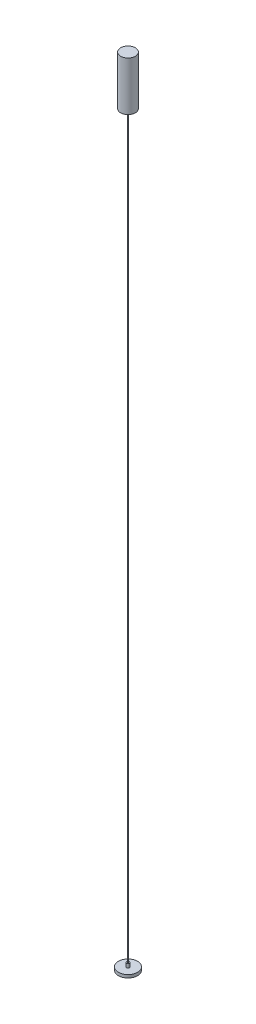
ISO-10303-21;
HEADER;
FILE_DESCRIPTION(('STEP AP214'),'2;1');
FILE_NAME('part.step','',(''),(''),'','','');
FILE_SCHEMA(('AUTOMOTIVE_DESIGN { 1 0 10303 214 1 1 1 1 }'));
ENDSEC;
DATA;
#1=APPLICATION_CONTEXT('core data for automotive mechanical design processes');
#2=APPLICATION_PROTOCOL_DEFINITION('international standard','automotive_design',2000,#1);
#3=PRODUCT_CONTEXT('',#1,'mechanical');
#4=PRODUCT('Part','Part','',(#3));
#5=PRODUCT_RELATED_PRODUCT_CATEGORY('part','',(#4));
#6=PRODUCT_DEFINITION_FORMATION('','',#4);
#7=PRODUCT_DEFINITION_CONTEXT('part definition',#1,'design');
#8=PRODUCT_DEFINITION('design','',#6,#7);
#9=PRODUCT_DEFINITION_SHAPE('','',#8);
#10=(LENGTH_UNIT() NAMED_UNIT(*) SI_UNIT(.MILLI.,.METRE.));
#11=(NAMED_UNIT(*) PLANE_ANGLE_UNIT() SI_UNIT($,.RADIAN.));
#12=(NAMED_UNIT(*) SI_UNIT($,.STERADIAN.) SOLID_ANGLE_UNIT());
#13=UNCERTAINTY_MEASURE_WITH_UNIT(LENGTH_MEASURE(1.E-05),#10,'distance_accuracy_value','');
#14=(GEOMETRIC_REPRESENTATION_CONTEXT(3) GLOBAL_UNCERTAINTY_ASSIGNED_CONTEXT((#13)) GLOBAL_UNIT_ASSIGNED_CONTEXT((#10,
#11,#12)) REPRESENTATION_CONTEXT('',''));
#15=CARTESIAN_POINT('',(0.,0.,0.));
#16=DIRECTION('',(0.,0.,1.));
#17=DIRECTION('',(1.,0.,0.));
#18=AXIS2_PLACEMENT_3D('',#15,#16,#17);
#19=CARTESIAN_POINT('',(0.,3242.,0.));
#20=DIRECTION('',(0.,-1.,0.));
#21=DIRECTION('',(0.,0.,-1.));
#22=AXIS2_PLACEMENT_3D('',#19,#20,#21);
#23=CYLINDRICAL_SURFACE('',#22,30.);
#24=CARTESIAN_POINT('',(0.,3242.,0.));
#25=DIRECTION('',(0.,1.,0.));
#26=DIRECTION('',(0.,0.,1.));
#27=AXIS2_PLACEMENT_3D('',#24,#25,#26);
#28=CIRCLE('',#27,30.);
#29=CARTESIAN_POINT('',(0.,3242.,30.));
#30=VERTEX_POINT('',#29);
#31=EDGE_CURVE('E11',#30,#30,#28,.T.);
#32=ORIENTED_EDGE('',*,*,#31,.F.);
#33=EDGE_LOOP('',(#32));
#34=FACE_BOUND('',#33,.T.);
#35=CARTESIAN_POINT('',(0.,3042.,0.));
#36=DIRECTION('',(0.,1.,0.));
#37=DIRECTION('',(0.,0.,1.));
#38=AXIS2_PLACEMENT_3D('',#35,#36,#37);
#39=CIRCLE('',#38,30.);
#40=CARTESIAN_POINT('',(0.,3042.,30.));
#41=VERTEX_POINT('',#40);
#42=EDGE_CURVE('E43',#41,#41,#39,.T.);
#43=ORIENTED_EDGE('',*,*,#42,.T.);
#44=EDGE_LOOP('',(#43));
#45=FACE_BOUND('',#44,.T.);
#46=ADVANCED_FACE('F40',(#34,#45),#23,.T.);
#47=CARTESIAN_POINT('',(0.,3242.,0.));
#48=DIRECTION('',(0.,1.,0.));
#49=DIRECTION('',(0.,0.,1.));
#50=AXIS2_PLACEMENT_3D('',#47,#48,#49);
#51=PLANE('',#50);
#52=ORIENTED_EDGE('',*,*,#31,.T.);
#53=EDGE_LOOP('',(#52));
#54=FACE_BOUND('',#53,.T.);
#55=ADVANCED_FACE('F55',(#54),#51,.T.);
#56=CARTESIAN_POINT('',(0.,3042.,0.));
#57=DIRECTION('',(0.,1.,0.));
#58=DIRECTION('',(0.,0.,1.));
#59=AXIS2_PLACEMENT_3D('',#56,#57,#58);
#60=PLANE('',#59);
#61=ORIENTED_EDGE('',*,*,#42,.F.);
#62=EDGE_LOOP('',(#61));
#63=FACE_BOUND('',#62,.T.);
#64=ADVANCED_FACE('F53',(#63),#60,.F.);
#65=CLOSED_SHELL('',(#46,#55,#64));
#66=MANIFOLD_SOLID_BREP('B2',#65);
#67=CARTESIAN_POINT('',(-0.223517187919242,3042.,0.));
#68=DIRECTION('',(0.,-1.,0.));
#69=DIRECTION('',(0.,0.,-1.));
#70=AXIS2_PLACEMENT_3D('',#67,#68,#69);
#71=CYLINDRICAL_SURFACE('',#70,6.);
#72=CARTESIAN_POINT('',(-0.223517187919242,3042.,0.));
#73=DIRECTION('',(0.,1.,0.));
#74=DIRECTION('',(0.,0.,1.));
#75=AXIS2_PLACEMENT_3D('',#72,#73,#74);
#76=CIRCLE('',#75,6.);
#77=CARTESIAN_POINT('',(-0.223517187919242,3042.,6.));
#78=VERTEX_POINT('',#77);
#79=EDGE_CURVE('E39',#78,#78,#76,.T.);
#80=ORIENTED_EDGE('',*,*,#79,.F.);
#81=EDGE_LOOP('',(#80));
#82=FACE_BOUND('',#81,.T.);
#83=CARTESIAN_POINT('',(-0.223517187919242,3027.,0.));
#84=DIRECTION('',(0.,1.,0.));
#85=DIRECTION('',(0.,0.,1.));
#86=AXIS2_PLACEMENT_3D('',#83,#84,#85);
#87=CIRCLE('',#86,6.);
#88=CARTESIAN_POINT('',(-0.223517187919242,3027.,6.));
#89=VERTEX_POINT('',#88);
#90=EDGE_CURVE('E92',#89,#89,#87,.T.);
#91=ORIENTED_EDGE('',*,*,#90,.T.);
#92=EDGE_LOOP('',(#91));
#93=FACE_BOUND('',#92,.T.);
#94=ADVANCED_FACE('F89',(#82,#93),#71,.T.);
#95=CARTESIAN_POINT('',(-0.223517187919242,3042.,0.));
#96=DIRECTION('',(0.,1.,0.));
#97=DIRECTION('',(0.,0.,1.));
#98=AXIS2_PLACEMENT_3D('',#95,#96,#97);
#99=PLANE('',#98);
#100=ORIENTED_EDGE('',*,*,#79,.T.);
#101=EDGE_LOOP('',(#100));
#102=FACE_BOUND('',#101,.T.);
#103=ADVANCED_FACE('F104',(#102),#99,.T.);
#104=CARTESIAN_POINT('',(-0.223517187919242,3027.,0.));
#105=DIRECTION('',(0.,1.,0.));
#106=DIRECTION('',(0.,0.,1.));
#107=AXIS2_PLACEMENT_3D('',#104,#105,#106);
#108=PLANE('',#107);
#109=ORIENTED_EDGE('',*,*,#90,.F.);
#110=EDGE_LOOP('',(#109));
#111=FACE_BOUND('',#110,.T.);
#112=ADVANCED_FACE('F102',(#111),#108,.F.);
#113=CLOSED_SHELL('',(#94,#103,#112));
#114=MANIFOLD_SOLID_BREP('B6',#113);
#115=CARTESIAN_POINT('',(0.,3027.,0.));
#116=DIRECTION('',(0.,-1.,0.));
#117=DIRECTION('',(0.,0.,-1.));
#118=AXIS2_PLACEMENT_3D('',#115,#116,#117);
#119=CYLINDRICAL_SURFACE('',#118,2.);
#120=CARTESIAN_POINT('',(0.,3027.,0.));
#121=DIRECTION('',(0.,1.,0.));
#122=DIRECTION('',(0.,0.,1.));
#123=AXIS2_PLACEMENT_3D('',#120,#121,#122);
#124=CIRCLE('',#123,2.);
#125=CARTESIAN_POINT('',(0.,3027.,2.));
#126=VERTEX_POINT('',#125);
#127=EDGE_CURVE('E88',#126,#126,#124,.T.);
#128=ORIENTED_EDGE('',*,*,#127,.F.);
#129=EDGE_LOOP('',(#128));
#130=FACE_BOUND('',#129,.T.);
#131=CARTESIAN_POINT('',(0.,27.,0.));
#132=DIRECTION('',(0.,1.,0.));
#133=DIRECTION('',(0.,0.,1.));
#134=AXIS2_PLACEMENT_3D('',#131,#132,#133);
#135=CIRCLE('',#134,2.);
#136=CARTESIAN_POINT('',(0.,27.,2.));
#137=VERTEX_POINT('',#136);
#138=EDGE_CURVE('E141',#137,#137,#135,.T.);
#139=ORIENTED_EDGE('',*,*,#138,.T.);
#140=EDGE_LOOP('',(#139));
#141=FACE_BOUND('',#140,.T.);
#142=ADVANCED_FACE('F138',(#130,#141),#119,.T.);
#143=CARTESIAN_POINT('',(0.,3027.,0.));
#144=DIRECTION('',(0.,1.,0.));
#145=DIRECTION('',(0.,0.,1.));
#146=AXIS2_PLACEMENT_3D('',#143,#144,#145);
#147=PLANE('',#146);
#148=ORIENTED_EDGE('',*,*,#127,.T.);
#149=EDGE_LOOP('',(#148));
#150=FACE_BOUND('',#149,.T.);
#151=ADVANCED_FACE('F153',(#150),#147,.T.);
#152=CARTESIAN_POINT('',(0.,27.,0.));
#153=DIRECTION('',(0.,1.,0.));
#154=DIRECTION('',(0.,0.,1.));
#155=AXIS2_PLACEMENT_3D('',#152,#153,#154);
#156=PLANE('',#155);
#157=ORIENTED_EDGE('',*,*,#138,.F.);
#158=EDGE_LOOP('',(#157));
#159=FACE_BOUND('',#158,.T.);
#160=ADVANCED_FACE('F151',(#159),#156,.F.);
#161=CLOSED_SHELL('',(#142,#151,#160));
#162=MANIFOLD_SOLID_BREP('B34',#161);
#163=CARTESIAN_POINT('',(0.,27.,0.));
#164=DIRECTION('',(0.,-1.,0.));
#165=DIRECTION('',(0.,0.,-1.));
#166=AXIS2_PLACEMENT_3D('',#163,#164,#165);
#167=CYLINDRICAL_SURFACE('',#166,6.);
#168=CARTESIAN_POINT('',(0.,27.,0.));
#169=DIRECTION('',(0.,1.,0.));
#170=DIRECTION('',(0.,0.,1.));
#171=AXIS2_PLACEMENT_3D('',#168,#169,#170);
#172=CIRCLE('',#171,6.);
#173=CARTESIAN_POINT('',(0.,27.,6.));
#174=VERTEX_POINT('',#173);
#175=EDGE_CURVE('E137',#174,#174,#172,.T.);
#176=ORIENTED_EDGE('',*,*,#175,.F.);
#177=EDGE_LOOP('',(#176));
#178=FACE_BOUND('',#177,.T.);
#179=CARTESIAN_POINT('',(0.,12.,0.));
#180=DIRECTION('',(0.,1.,0.));
#181=DIRECTION('',(0.,0.,1.));
#182=AXIS2_PLACEMENT_3D('',#179,#180,#181);
#183=CIRCLE('',#182,6.);
#184=CARTESIAN_POINT('',(0.,12.,6.));
#185=VERTEX_POINT('',#184);
#186=EDGE_CURVE('E189',#185,#185,#183,.T.);
#187=ORIENTED_EDGE('',*,*,#186,.T.);
#188=EDGE_LOOP('',(#187));
#189=FACE_BOUND('',#188,.T.);
#190=ADVANCED_FACE('F186',(#178,#189),#167,.T.);
#191=CARTESIAN_POINT('',(0.,27.,0.));
#192=DIRECTION('',(0.,1.,0.));
#193=DIRECTION('',(0.,0.,1.));
#194=AXIS2_PLACEMENT_3D('',#191,#192,#193);
#195=PLANE('',#194);
#196=ORIENTED_EDGE('',*,*,#175,.T.);
#197=EDGE_LOOP('',(#196));
#198=FACE_BOUND('',#197,.T.);
#199=ADVANCED_FACE('F201',(#198),#195,.T.);
#200=CARTESIAN_POINT('',(0.,12.,0.));
#201=DIRECTION('',(0.,1.,0.));
#202=DIRECTION('',(0.,0.,1.));
#203=AXIS2_PLACEMENT_3D('',#200,#201,#202);
#204=PLANE('',#203);
#205=ORIENTED_EDGE('',*,*,#186,.F.);
#206=EDGE_LOOP('',(#205));
#207=FACE_BOUND('',#206,.T.);
#208=ADVANCED_FACE('F199',(#207),#204,.F.);
#209=CLOSED_SHELL('',(#190,#199,#208));
#210=MANIFOLD_SOLID_BREP('B83',#209);
#211=CARTESIAN_POINT('',(0.,12.,0.));
#212=DIRECTION('',(0.,-1.,0.));
#213=DIRECTION('',(0.,0.,-1.));
#214=AXIS2_PLACEMENT_3D('',#211,#212,#213);
#215=CYLINDRICAL_SURFACE('',#214,39.);
#216=CARTESIAN_POINT('',(0.,12.,0.));
#217=DIRECTION('',(0.,1.,0.));
#218=DIRECTION('',(0.,0.,1.));
#219=AXIS2_PLACEMENT_3D('',#216,#217,#218);
#220=CIRCLE('',#219,39.);
#221=CARTESIAN_POINT('',(0.,12.,39.));
#222=VERTEX_POINT('',#221);
#223=EDGE_CURVE('E185',#222,#222,#220,.T.);
#224=ORIENTED_EDGE('',*,*,#223,.F.);
#225=EDGE_LOOP('',(#224));
#226=FACE_BOUND('',#225,.T.);
#227=CARTESIAN_POINT('',(0.,0.,0.));
#228=DIRECTION('',(0.,1.,0.));
#229=DIRECTION('',(0.,0.,1.));
#230=AXIS2_PLACEMENT_3D('',#227,#228,#229);
#231=CIRCLE('',#230,39.);
#232=CARTESIAN_POINT('',(0.,0.,39.));
#233=VERTEX_POINT('',#232);
#234=EDGE_CURVE('E230',#233,#233,#231,.T.);
#235=ORIENTED_EDGE('',*,*,#234,.T.);
#236=EDGE_LOOP('',(#235));
#237=FACE_BOUND('',#236,.T.);
#238=ADVANCED_FACE('F227',(#226,#237),#215,.T.);
#239=CARTESIAN_POINT('',(0.,12.,0.));
#240=DIRECTION('',(0.,1.,0.));
#241=DIRECTION('',(0.,0.,1.));
#242=AXIS2_PLACEMENT_3D('',#239,#240,#241);
#243=PLANE('',#242);
#244=ORIENTED_EDGE('',*,*,#223,.T.);
#245=EDGE_LOOP('',(#244));
#246=FACE_BOUND('',#245,.T.);
#247=ADVANCED_FACE('F242',(#246),#243,.T.);
#248=CARTESIAN_POINT('',(0.,0.,0.));
#249=DIRECTION('',(0.,1.,0.));
#250=DIRECTION('',(0.,0.,1.));
#251=AXIS2_PLACEMENT_3D('',#248,#249,#250);
#252=PLANE('',#251);
#253=ORIENTED_EDGE('',*,*,#234,.F.);
#254=EDGE_LOOP('',(#253));
#255=FACE_BOUND('',#254,.T.);
#256=ADVANCED_FACE('F240',(#255),#252,.F.);
#257=CLOSED_SHELL('',(#238,#247,#256));
#258=MANIFOLD_SOLID_BREP('B132',#257);
#259=ADVANCED_BREP_SHAPE_REPRESENTATION('',(#18,#66,#114,#162,#210,#258),#14);
#260=SHAPE_DEFINITION_REPRESENTATION(#9,#259);
ENDSEC;
END-ISO-10303-21;
